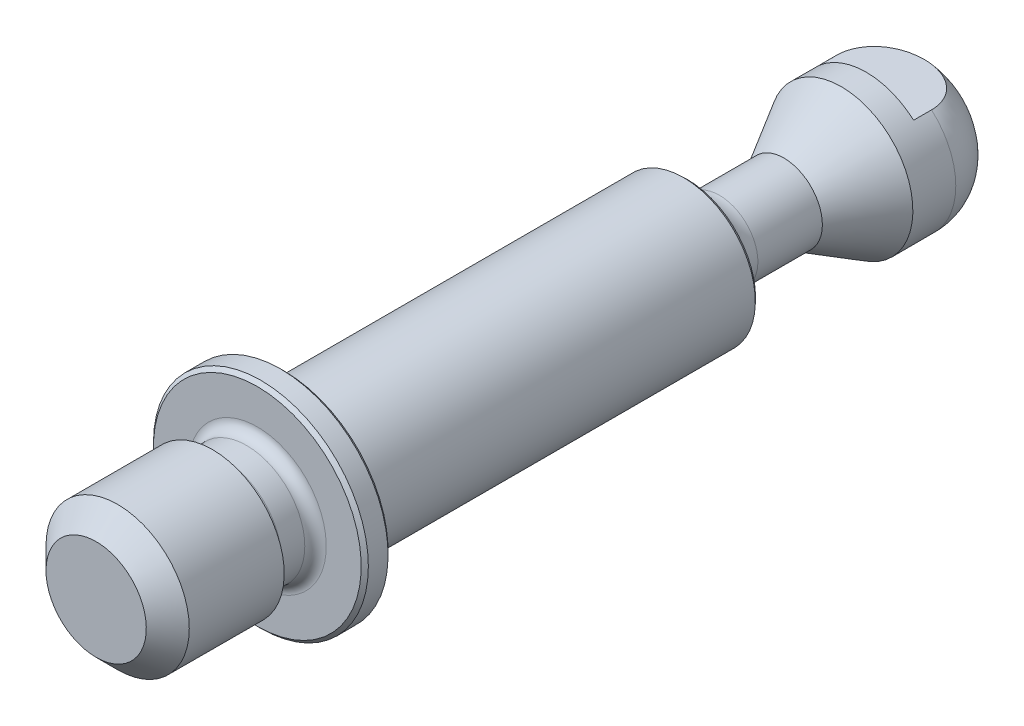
ISO-10303-21;
HEADER;
FILE_DESCRIPTION(('STEP AP214'),'2;1');
FILE_NAME('part.step','',(''),(''),'','','');
FILE_SCHEMA(('AUTOMOTIVE_DESIGN { 1 0 10303 214 1 1 1 1 }'));
ENDSEC;
DATA;
#1=APPLICATION_CONTEXT('core data for automotive mechanical design processes');
#2=APPLICATION_PROTOCOL_DEFINITION('international standard','automotive_design',2000,#1);
#3=PRODUCT_CONTEXT('',#1,'mechanical');
#4=PRODUCT('Part','Part','',(#3));
#5=PRODUCT_RELATED_PRODUCT_CATEGORY('part','',(#4));
#6=PRODUCT_DEFINITION_FORMATION('','',#4);
#7=PRODUCT_DEFINITION_CONTEXT('part definition',#1,'design');
#8=PRODUCT_DEFINITION('design','',#6,#7);
#9=PRODUCT_DEFINITION_SHAPE('','',#8);
#10=(LENGTH_UNIT() NAMED_UNIT(*) SI_UNIT(.MILLI.,.METRE.));
#11=(NAMED_UNIT(*) PLANE_ANGLE_UNIT() SI_UNIT($,.RADIAN.));
#12=(NAMED_UNIT(*) SI_UNIT($,.STERADIAN.) SOLID_ANGLE_UNIT());
#13=UNCERTAINTY_MEASURE_WITH_UNIT(LENGTH_MEASURE(1.E-05),#10,'distance_accuracy_value','');
#14=(GEOMETRIC_REPRESENTATION_CONTEXT(3) GLOBAL_UNCERTAINTY_ASSIGNED_CONTEXT((#13)) GLOBAL_UNIT_ASSIGNED_CONTEXT((#10,
#11,#12)) REPRESENTATION_CONTEXT('',''));
#15=CARTESIAN_POINT('',(0.,0.,0.));
#16=DIRECTION('',(0.,0.,1.));
#17=DIRECTION('',(1.,0.,0.));
#18=AXIS2_PLACEMENT_3D('',#15,#16,#17);
#19=CARTESIAN_POINT('',(0.,0.,0.));
#20=DIRECTION('',(0.,0.,1.));
#21=DIRECTION('',(0.,1.,0.));
#22=AXIS2_PLACEMENT_3D('',#19,#20,#21);
#23=CYLINDRICAL_SURFACE('',#22,6.);
#24=CARTESIAN_POINT('',(0.,0.,-0.2));
#25=DIRECTION('',(0.,0.,-1.));
#26=DIRECTION('',(0.,-1.,0.));
#27=AXIS2_PLACEMENT_3D('',#24,#25,#26);
#28=CIRCLE('',#27,6.);
#29=CARTESIAN_POINT('',(0.,-6.,-0.2));
#30=VERTEX_POINT('',#29);
#31=EDGE_CURVE('E228',#30,#30,#28,.T.);
#32=ORIENTED_EDGE('',*,*,#31,.T.);
#33=EDGE_LOOP('',(#32));
#34=FACE_BOUND('',#33,.T.);
#35=CARTESIAN_POINT('',(0.,0.,-1.3));
#36=DIRECTION('',(0.,0.,1.));
#37=DIRECTION('',(0.,1.,0.));
#38=AXIS2_PLACEMENT_3D('',#35,#36,#37);
#39=CIRCLE('',#38,6.);
#40=CARTESIAN_POINT('',(0.,6.,-1.3));
#41=VERTEX_POINT('',#40);
#42=EDGE_CURVE('E233',#41,#41,#39,.T.);
#43=ORIENTED_EDGE('',*,*,#42,.T.);
#44=EDGE_LOOP('',(#43));
#45=FACE_BOUND('',#44,.T.);
#46=ADVANCED_FACE('F15',(#34,#45),#23,.T.);
#47=CARTESIAN_POINT('',(-6.,0.,-1.5));
#48=DIRECTION('',(0.,0.,1.));
#49=DIRECTION('',(0.,1.,0.));
#50=AXIS2_PLACEMENT_3D('',#47,#48,#49);
#51=PLANE('',#50);
#52=CARTESIAN_POINT('',(0.,0.,-1.5));
#53=DIRECTION('',(0.,0.,1.));
#54=DIRECTION('',(0.,1.,0.));
#55=AXIS2_PLACEMENT_3D('',#52,#53,#54);
#56=CIRCLE('',#55,5.8);
#57=CARTESIAN_POINT('',(0.,5.8,-1.5));
#58=VERTEX_POINT('',#57);
#59=EDGE_CURVE('E226',#58,#58,#56,.F.);
#60=ORIENTED_EDGE('',*,*,#59,.T.);
#61=EDGE_LOOP('',(#60));
#62=FACE_BOUND('',#61,.T.);
#63=CARTESIAN_POINT('',(0.,0.,-1.5));
#64=DIRECTION('',(0.,0.,1.));
#65=DIRECTION('',(0.,1.,0.));
#66=AXIS2_PLACEMENT_3D('',#63,#64,#65);
#67=CIRCLE('',#66,4.4);
#68=CARTESIAN_POINT('',(0.,4.4,-1.5));
#69=VERTEX_POINT('',#68);
#70=EDGE_CURVE('E111',#69,#69,#67,.T.);
#71=ORIENTED_EDGE('',*,*,#70,.T.);
#72=EDGE_LOOP('',(#71));
#73=FACE_BOUND('',#72,.T.);
#74=ADVANCED_FACE('F183',(#62,#73),#51,.F.);
#75=CARTESIAN_POINT('',(0.,0.,0.));
#76=DIRECTION('',(0.,0.,1.));
#77=DIRECTION('',(0.,1.,0.));
#78=AXIS2_PLACEMENT_3D('',#75,#76,#77);
#79=CYLINDRICAL_SURFACE('',#78,4.);
#80=CARTESIAN_POINT('',(0.,0.,-23.8056329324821));
#81=DIRECTION('',(0.,0.,1.));
#82=DIRECTION('',(0.,1.,0.));
#83=AXIS2_PLACEMENT_3D('',#80,#81,#82);
#84=CIRCLE('',#83,4.);
#85=CARTESIAN_POINT('',(0.,4.,-23.8056329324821));
#86=VERTEX_POINT('',#85);
#87=EDGE_CURVE('E23',#86,#86,#84,.T.);
#88=ORIENTED_EDGE('',*,*,#87,.T.);
#89=EDGE_LOOP('',(#88));
#90=FACE_BOUND('',#89,.T.);
#91=CARTESIAN_POINT('',(0.,0.,-1.9));
#92=DIRECTION('',(0.,0.,1.));
#93=DIRECTION('',(0.,1.,0.));
#94=AXIS2_PLACEMENT_3D('',#91,#92,#93);
#95=CIRCLE('',#94,4.);
#96=CARTESIAN_POINT('',(0.,4.,-1.9));
#97=VERTEX_POINT('',#96);
#98=EDGE_CURVE('E114',#97,#97,#95,.F.);
#99=ORIENTED_EDGE('',*,*,#98,.T.);
#100=EDGE_LOOP('',(#99));
#101=FACE_BOUND('',#100,.T.);
#102=ADVANCED_FACE('F179',(#90,#101),#79,.T.);
#103=CARTESIAN_POINT('',(0.,0.,0.));
#104=DIRECTION('',(0.,0.,1.));
#105=DIRECTION('',(0.,1.,0.));
#106=AXIS2_PLACEMENT_3D('',#103,#104,#105);
#107=CYLINDRICAL_SURFACE('',#106,2.15);
#108=CARTESIAN_POINT('',(0.,0.,-25.8));
#109=DIRECTION('',(0.,0.,1.));
#110=DIRECTION('',(0.,1.,0.));
#111=AXIS2_PLACEMENT_3D('',#108,#109,#110);
#112=CIRCLE('',#111,2.15);
#113=CARTESIAN_POINT('',(0.,2.15,-25.8));
#114=VERTEX_POINT('',#113);
#115=EDGE_CURVE('E117',#114,#114,#112,.F.);
#116=ORIENTED_EDGE('',*,*,#115,.T.);
#117=EDGE_LOOP('',(#116));
#118=FACE_BOUND('',#117,.T.);
#119=CARTESIAN_POINT('',(0.,0.,-29.4));
#120=DIRECTION('',(0.,0.,1.));
#121=DIRECTION('',(0.,1.,0.));
#122=AXIS2_PLACEMENT_3D('',#119,#120,#121);
#123=CIRCLE('',#122,2.15);
#124=CARTESIAN_POINT('',(0.,2.15,-29.4));
#125=VERTEX_POINT('',#124);
#126=EDGE_CURVE('E90',#125,#125,#123,.T.);
#127=ORIENTED_EDGE('',*,*,#126,.T.);
#128=EDGE_LOOP('',(#127));
#129=FACE_BOUND('',#128,.T.);
#130=ADVANCED_FACE('F175',(#118,#129),#107,.T.);
#131=CARTESIAN_POINT('',(0.,0.,-32.6042939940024));
#132=DIRECTION('',(0.,0.,-1.));
#133=DIRECTION('',(0.,-1.,0.));
#134=AXIS2_PLACEMENT_3D('',#131,#132,#133);
#135=CONICAL_SURFACE('',#134,4.,0.523598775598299);
#136=ORIENTED_EDGE('',*,*,#126,.F.);
#137=EDGE_LOOP('',(#136));
#138=FACE_BOUND('',#137,.T.);
#139=CARTESIAN_POINT('',(0.,0.,-32.6042939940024));
#140=DIRECTION('',(0.,0.,1.));
#141=DIRECTION('',(0.,1.,0.));
#142=AXIS2_PLACEMENT_3D('',#139,#140,#141);
#143=CIRCLE('',#142,4.);
#144=CARTESIAN_POINT('',(0.,4.,-32.6042939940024));
#145=VERTEX_POINT('',#144);
#146=EDGE_CURVE('E87',#145,#145,#143,.T.);
#147=ORIENTED_EDGE('',*,*,#146,.T.);
#148=EDGE_LOOP('',(#147));
#149=FACE_BOUND('',#148,.T.);
#150=ADVANCED_FACE('F172',(#138,#149),#135,.T.);
#151=CARTESIAN_POINT('',(0.,0.,0.));
#152=DIRECTION('',(0.,0.,1.));
#153=DIRECTION('',(0.,1.,0.));
#154=AXIS2_PLACEMENT_3D('',#151,#152,#153);
#155=CYLINDRICAL_SURFACE('',#154,4.);
#156=CARTESIAN_POINT('',(0.,0.,-35.));
#157=DIRECTION('',(0.,0.,1.));
#158=DIRECTION('',(0.,1.,0.));
#159=AXIS2_PLACEMENT_3D('',#156,#157,#158);
#160=CIRCLE('',#159,4.);
#161=CARTESIAN_POINT('',(-2.6457513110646,3.,-35.));
#162=VERTEX_POINT('',#161);
#163=CARTESIAN_POINT('',(-2.6457513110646,-3.,-35.));
#164=VERTEX_POINT('',#163);
#165=EDGE_CURVE('E73',#162,#164,#160,.T.);
#166=ORIENTED_EDGE('',*,*,#165,.T.);
#167=DIRECTION('',(0.,0.,1.));
#168=VECTOR('',#167,1.);
#169=CARTESIAN_POINT('',(-2.6457513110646,-3.,0.));
#170=LINE('',#169,#168);
#171=CARTESIAN_POINT('',(-2.6457513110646,-3.,-34.));
#172=VERTEX_POINT('',#171);
#173=EDGE_CURVE('E30',#164,#172,#170,.T.);
#174=ORIENTED_EDGE('',*,*,#173,.T.);
#175=CARTESIAN_POINT('',(0.,0.,-34.));
#176=DIRECTION('',(0.,0.,-1.));
#177=DIRECTION('',(0.,-1.,0.));
#178=AXIS2_PLACEMENT_3D('',#175,#176,#177);
#179=CIRCLE('',#178,4.);
#180=CARTESIAN_POINT('',(2.6457513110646,-3.,-34.));
#181=VERTEX_POINT('',#180);
#182=EDGE_CURVE('E59',#181,#172,#179,.T.);
#183=ORIENTED_EDGE('',*,*,#182,.F.);
#184=DIRECTION('',(0.,0.,1.));
#185=VECTOR('',#184,1.);
#186=CARTESIAN_POINT('',(2.6457513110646,-3.,0.));
#187=LINE('',#186,#185);
#188=CARTESIAN_POINT('',(2.6457513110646,-3.,-35.));
#189=VERTEX_POINT('',#188);
#190=EDGE_CURVE('E66',#181,#189,#187,.F.);
#191=ORIENTED_EDGE('',*,*,#190,.T.);
#192=CARTESIAN_POINT('',(2.6457513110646,3.,-35.));
#193=VERTEX_POINT('',#192);
#194=EDGE_CURVE('E38',#189,#193,#160,.T.);
#195=ORIENTED_EDGE('',*,*,#194,.T.);
#196=DIRECTION('',(0.,0.,1.));
#197=VECTOR('',#196,1.);
#198=CARTESIAN_POINT('',(2.6457513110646,3.,0.));
#199=LINE('',#198,#197);
#200=CARTESIAN_POINT('',(2.6457513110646,3.,-34.));
#201=VERTEX_POINT('',#200);
#202=EDGE_CURVE('E82',#193,#201,#199,.T.);
#203=ORIENTED_EDGE('',*,*,#202,.T.);
#204=CARTESIAN_POINT('',(0.,0.,-34.));
#205=DIRECTION('',(0.,0.,-1.));
#206=DIRECTION('',(0.,-1.,0.));
#207=AXIS2_PLACEMENT_3D('',#204,#205,#206);
#208=CIRCLE('',#207,4.);
#209=CARTESIAN_POINT('',(-2.6457513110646,3.,-34.));
#210=VERTEX_POINT('',#209);
#211=EDGE_CURVE('E131',#210,#201,#208,.T.);
#212=ORIENTED_EDGE('',*,*,#211,.F.);
#213=DIRECTION('',(0.,0.,1.));
#214=VECTOR('',#213,1.);
#215=CARTESIAN_POINT('',(-2.6457513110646,3.,0.));
#216=LINE('',#215,#214);
#217=EDGE_CURVE('E77',#210,#162,#216,.F.);
#218=ORIENTED_EDGE('',*,*,#217,.T.);
#219=EDGE_LOOP('',(#166,#174,#183,#191,#195,#203,#212,#218));
#220=FACE_BOUND('',#219,.T.);
#221=ORIENTED_EDGE('',*,*,#146,.F.);
#222=EDGE_LOOP('',(#221));
#223=FACE_BOUND('',#222,.T.);
#224=ADVANCED_FACE('F69',(#220,#223),#155,.T.);
#225=CARTESIAN_POINT('',(0.,0.,-38.));
#226=DIRECTION('',(0.,0.,1.));
#227=DIRECTION('',(0.,1.,0.));
#228=AXIS2_PLACEMENT_3D('',#225,#226,#227);
#229=PLANE('',#228);
#230=CARTESIAN_POINT('',(0.,0.,-38.));
#231=DIRECTION('',(0.,0.,1.));
#232=DIRECTION('',(0.,1.,0.));
#233=AXIS2_PLACEMENT_3D('',#230,#231,#232);
#234=CIRCLE('',#233,1.);
#235=CARTESIAN_POINT('',(0.,1.,-38.));
#236=VERTEX_POINT('',#235);
#237=EDGE_CURVE('E121',#236,#236,#234,.F.);
#238=ORIENTED_EDGE('',*,*,#237,.T.);
#239=EDGE_LOOP('',(#238));
#240=FACE_BOUND('',#239,.T.);
#241=ADVANCED_FACE('F165',(#240),#229,.F.);
#242=CARTESIAN_POINT('',(-4.,0.,9.));
#243=DIRECTION('',(0.,0.,-1.));
#244=DIRECTION('',(0.,-1.,0.));
#245=AXIS2_PLACEMENT_3D('',#242,#243,#244);
#246=PLANE('',#245);
#247=CARTESIAN_POINT('',(0.,0.,9.));
#248=DIRECTION('',(0.,0.,-1.));
#249=DIRECTION('',(0.,-1.,0.));
#250=AXIS2_PLACEMENT_3D('',#247,#248,#249);
#251=CIRCLE('',#250,2.8);
#252=CARTESIAN_POINT('',(0.,-2.8,9.));
#253=VERTEX_POINT('',#252);
#254=EDGE_CURVE('E93',#253,#253,#251,.F.);
#255=ORIENTED_EDGE('',*,*,#254,.T.);
#256=EDGE_LOOP('',(#255));
#257=FACE_BOUND('',#256,.T.);
#258=ADVANCED_FACE('F161',(#257),#246,.F.);
#259=CARTESIAN_POINT('',(0.,0.,0.));
#260=DIRECTION('',(0.,0.,1.));
#261=DIRECTION('',(0.,1.,0.));
#262=AXIS2_PLACEMENT_3D('',#259,#260,#261);
#263=CYLINDRICAL_SURFACE('',#262,4.);
#264=CARTESIAN_POINT('',(0.,0.,7.8));
#265=DIRECTION('',(0.,0.,-1.));
#266=DIRECTION('',(0.,-1.,0.));
#267=AXIS2_PLACEMENT_3D('',#264,#265,#266);
#268=CIRCLE('',#267,4.);
#269=CARTESIAN_POINT('',(0.,-4.,7.8));
#270=VERTEX_POINT('',#269);
#271=EDGE_CURVE('E96',#270,#270,#268,.T.);
#272=ORIENTED_EDGE('',*,*,#271,.T.);
#273=EDGE_LOOP('',(#272));
#274=FACE_BOUND('',#273,.T.);
#275=CARTESIAN_POINT('',(0.,0.,2.5));
#276=DIRECTION('',(0.,0.,1.));
#277=DIRECTION('',(0.,1.,0.));
#278=AXIS2_PLACEMENT_3D('',#275,#276,#277);
#279=CIRCLE('',#278,4.);
#280=CARTESIAN_POINT('',(0.,4.,2.5));
#281=VERTEX_POINT('',#280);
#282=EDGE_CURVE('E84',#281,#281,#279,.T.);
#283=ORIENTED_EDGE('',*,*,#282,.T.);
#284=EDGE_LOOP('',(#283));
#285=FACE_BOUND('',#284,.T.);
#286=ADVANCED_FACE('F157',(#274,#285),#263,.T.);
#287=CARTESIAN_POINT('',(-3.25,0.,2.5));
#288=DIRECTION('',(0.,0.,1.));
#289=DIRECTION('',(0.,1.,0.));
#290=AXIS2_PLACEMENT_3D('',#287,#288,#289);
#291=PLANE('',#290);
#292=CARTESIAN_POINT('',(0.,0.,2.5));
#293=DIRECTION('',(0.,0.,1.));
#294=DIRECTION('',(0.,1.,0.));
#295=AXIS2_PLACEMENT_3D('',#292,#293,#294);
#296=CIRCLE('',#295,3.85);
#297=CARTESIAN_POINT('',(0.,3.85,2.5));
#298=VERTEX_POINT('',#297);
#299=EDGE_CURVE('E99',#298,#298,#296,.T.);
#300=ORIENTED_EDGE('',*,*,#299,.T.);
#301=EDGE_LOOP('',(#300));
#302=FACE_BOUND('',#301,.T.);
#303=ORIENTED_EDGE('',*,*,#282,.F.);
#304=EDGE_LOOP('',(#303));
#305=FACE_BOUND('',#304,.T.);
#306=ADVANCED_FACE('F153',(#302,#305),#291,.F.);
#307=CARTESIAN_POINT('',(0.,0.,0.));
#308=DIRECTION('',(0.,0.,1.));
#309=DIRECTION('',(0.,1.,0.));
#310=AXIS2_PLACEMENT_3D('',#307,#308,#309);
#311=CYLINDRICAL_SURFACE('',#310,3.25);
#312=CARTESIAN_POINT('',(0.,0.,1.9));
#313=DIRECTION('',(0.,0.,1.));
#314=DIRECTION('',(0.,1.,0.));
#315=AXIS2_PLACEMENT_3D('',#312,#313,#314);
#316=CIRCLE('',#315,3.25);
#317=CARTESIAN_POINT('',(0.,3.25,1.9));
#318=VERTEX_POINT('',#317);
#319=EDGE_CURVE('E105',#318,#318,#316,.F.);
#320=ORIENTED_EDGE('',*,*,#319,.T.);
#321=EDGE_LOOP('',(#320));
#322=FACE_BOUND('',#321,.T.);
#323=CARTESIAN_POINT('',(0.,0.,0.6));
#324=DIRECTION('',(0.,0.,-1.));
#325=DIRECTION('',(0.,-1.,0.));
#326=AXIS2_PLACEMENT_3D('',#323,#324,#325);
#327=CIRCLE('',#326,3.25);
#328=CARTESIAN_POINT('',(0.,-3.25,0.6));
#329=VERTEX_POINT('',#328);
#330=EDGE_CURVE('E102',#329,#329,#327,.F.);
#331=ORIENTED_EDGE('',*,*,#330,.T.);
#332=EDGE_LOOP('',(#331));
#333=FACE_BOUND('',#332,.T.);
#334=ADVANCED_FACE('F149',(#322,#333),#311,.T.);
#335=CARTESIAN_POINT('',(-3.25,0.,0.));
#336=DIRECTION('',(0.,0.,-1.));
#337=DIRECTION('',(0.,-1.,0.));
#338=AXIS2_PLACEMENT_3D('',#335,#336,#337);
#339=PLANE('',#338);
#340=CARTESIAN_POINT('',(0.,0.,0.));
#341=DIRECTION('',(0.,0.,-1.));
#342=DIRECTION('',(0.,-1.,0.));
#343=AXIS2_PLACEMENT_3D('',#340,#341,#342);
#344=CIRCLE('',#343,5.8);
#345=CARTESIAN_POINT('',(0.,-5.8,0.));
#346=VERTEX_POINT('',#345);
#347=EDGE_CURVE('E62',#346,#346,#344,.F.);
#348=ORIENTED_EDGE('',*,*,#347,.T.);
#349=EDGE_LOOP('',(#348));
#350=FACE_BOUND('',#349,.T.);
#351=CARTESIAN_POINT('',(0.,0.,0.));
#352=DIRECTION('',(0.,0.,-1.));
#353=DIRECTION('',(0.,-1.,0.));
#354=AXIS2_PLACEMENT_3D('',#351,#352,#353);
#355=CIRCLE('',#354,3.85);
#356=CARTESIAN_POINT('',(0.,-3.85,0.));
#357=VERTEX_POINT('',#356);
#358=EDGE_CURVE('E108',#357,#357,#355,.T.);
#359=ORIENTED_EDGE('',*,*,#358,.T.);
#360=EDGE_LOOP('',(#359));
#361=FACE_BOUND('',#360,.T.);
#362=ADVANCED_FACE('F145',(#350,#361),#339,.F.);
#363=CARTESIAN_POINT('',(0.,0.,9.));
#364=DIRECTION('',(0.,0.,-1.));
#365=DIRECTION('',(0.,-1.,0.));
#366=AXIS2_PLACEMENT_3D('',#363,#364,#365);
#367=CONICAL_SURFACE('',#366,2.8,0.785398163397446);
#368=ORIENTED_EDGE('',*,*,#271,.F.);
#369=EDGE_LOOP('',(#368));
#370=FACE_BOUND('',#369,.T.);
#371=ORIENTED_EDGE('',*,*,#254,.F.);
#372=EDGE_LOOP('',(#371));
#373=FACE_BOUND('',#372,.T.);
#374=ADVANCED_FACE('F148',(#370,#373),#367,.T.);
#375=CARTESIAN_POINT('',(0.,0.,1.9));
#376=DIRECTION('',(0.,0.,1.));
#377=DIRECTION('',(0.,1.,0.));
#378=AXIS2_PLACEMENT_3D('',#375,#376,#377);
#379=TOROIDAL_SURFACE('',#378,3.85,0.6);
#380=ORIENTED_EDGE('',*,*,#319,.F.);
#381=EDGE_LOOP('',(#380));
#382=FACE_BOUND('',#381,.T.);
#383=ORIENTED_EDGE('',*,*,#299,.F.);
#384=EDGE_LOOP('',(#383));
#385=FACE_BOUND('',#384,.T.);
#386=ADVANCED_FACE('F193',(#382,#385),#379,.F.);
#387=CARTESIAN_POINT('',(0.,0.,0.6));
#388=DIRECTION('',(0.,0.,-1.));
#389=DIRECTION('',(0.,-1.,0.));
#390=AXIS2_PLACEMENT_3D('',#387,#388,#389);
#391=TOROIDAL_SURFACE('',#390,3.85,0.6);
#392=ORIENTED_EDGE('',*,*,#358,.F.);
#393=EDGE_LOOP('',(#392));
#394=FACE_BOUND('',#393,.T.);
#395=ORIENTED_EDGE('',*,*,#330,.F.);
#396=EDGE_LOOP('',(#395));
#397=FACE_BOUND('',#396,.T.);
#398=ADVANCED_FACE('F197',(#394,#397),#391,.F.);
#399=CARTESIAN_POINT('',(0.,0.,-1.9));
#400=DIRECTION('',(0.,0.,1.));
#401=DIRECTION('',(0.,1.,0.));
#402=AXIS2_PLACEMENT_3D('',#399,#400,#401);
#403=TOROIDAL_SURFACE('',#402,4.4,0.4);
#404=ORIENTED_EDGE('',*,*,#98,.F.);
#405=EDGE_LOOP('',(#404));
#406=FACE_BOUND('',#405,.T.);
#407=ORIENTED_EDGE('',*,*,#70,.F.);
#408=EDGE_LOOP('',(#407));
#409=FACE_BOUND('',#408,.T.);
#410=ADVANCED_FACE('F201',(#406,#409),#403,.F.);
#411=CARTESIAN_POINT('',(0.,0.,-25.8));
#412=DIRECTION('',(0.,0.,1.));
#413=DIRECTION('',(0.,1.,0.));
#414=AXIS2_PLACEMENT_3D('',#411,#412,#413);
#415=TOROIDAL_SURFACE('',#414,3.95,1.8);
#416=CARTESIAN_POINT('',(0.,0.,-24.0050696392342));
#417=DIRECTION('',(0.,0.,-1.));
#418=DIRECTION('',(0.,-1.,0.));
#419=AXIS2_PLACEMENT_3D('',#416,#417,#418);
#420=CIRCLE('',#419,3.815);
#421=CARTESIAN_POINT('',(0.,-3.815,-24.0050696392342));
#422=VERTEX_POINT('',#421);
#423=EDGE_CURVE('E10',#422,#422,#420,.T.);
#424=ORIENTED_EDGE('',*,*,#423,.T.);
#425=EDGE_LOOP('',(#424));
#426=FACE_BOUND('',#425,.T.);
#427=ORIENTED_EDGE('',*,*,#115,.F.);
#428=EDGE_LOOP('',(#427));
#429=FACE_BOUND('',#428,.T.);
#430=ADVANCED_FACE('F204',(#426,#429),#415,.F.);
#431=CARTESIAN_POINT('',(0.,0.,-35.));
#432=DIRECTION('',(0.,0.,1.));
#433=DIRECTION('',(0.,1.,0.));
#434=AXIS2_PLACEMENT_3D('',#431,#432,#433);
#435=DEGENERATE_TOROIDAL_SURFACE('',#434,1.,3.,.T.);
#436=CARTESIAN_POINT('',(0.,-3.,-37.2360679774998));
#437=CARTESIAN_POINT('',(0.182130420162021,-3.,-37.2360730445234));
#438=CARTESIAN_POINT('',(0.364315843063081,-3.,-37.2213187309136));
#439=CARTESIAN_POINT('',(0.723592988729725,-3.,-37.1613493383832));
#440=CARTESIAN_POINT('',(0.900689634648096,-3.,-37.1161648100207));
#441=CARTESIAN_POINT('',(1.20801765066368,-3.,-37.0061514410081));
#442=CARTESIAN_POINT('',(1.3403812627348,-3.,-36.9472966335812));
#443=CARTESIAN_POINT('',(1.59371415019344,-3.,-36.8086382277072));
#444=CARTESIAN_POINT('',(1.71469026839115,-3.,-36.7288473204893));
#445=CARTESIAN_POINT('',(1.94131475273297,-3.,-36.548058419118));
#446=CARTESIAN_POINT('',(2.04683753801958,-3.,-36.4469014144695));
#447=CARTESIAN_POINT('',(2.23610882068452,-3.,-36.2258543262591));
#448=CARTESIAN_POINT('',(2.31987165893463,-3.,-36.1059766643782));
#449=CARTESIAN_POINT('',(2.45137620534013,-3.,-35.8685696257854));
#450=CARTESIAN_POINT('',(2.50243931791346,-3.,-35.7528750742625));
#451=CARTESIAN_POINT('',(2.58222641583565,-3.,-35.5140328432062));
#452=CARTESIAN_POINT('',(2.61096503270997,-3.,-35.3908901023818));
#453=CARTESIAN_POINT('',(2.64317885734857,-3.,-35.1526642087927));
#454=CARTESIAN_POINT('',(2.64869439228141,-3.,-35.0378527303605));
#455=CARTESIAN_POINT('',(2.6398528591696,-3.,-34.8090131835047));
#456=CARTESIAN_POINT('',(2.62550060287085,-3.,-34.6949849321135));
#457=CARTESIAN_POINT('',(2.57811323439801,-3.,-34.4737675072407));
#458=CARTESIAN_POINT('',(2.54553396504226,-3.,-34.366479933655));
#459=CARTESIAN_POINT('',(2.4633087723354,-3.,-34.158681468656));
#460=CARTESIAN_POINT('',(2.41366206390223,-3.,-34.0581708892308));
#461=CARTESIAN_POINT('',(2.29748673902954,-3.,-33.8635303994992));
#462=CARTESIAN_POINT('',(2.23051545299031,-3.,-33.769665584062));
#463=CARTESIAN_POINT('',(2.08284770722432,-3.,-33.5934794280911));
#464=CARTESIAN_POINT('',(2.00214781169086,-3.,-33.5111609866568));
#465=CARTESIAN_POINT('',(1.8226461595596,-3.,-33.3531312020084));
#466=CARTESIAN_POINT('',(1.72291044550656,-3.,-33.2784840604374));
#467=CARTESIAN_POINT('',(1.5136045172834,-3.,-33.1446444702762));
#468=CARTESIAN_POINT('',(1.40403016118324,-3.,-33.0854585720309));
#469=CARTESIAN_POINT('',(1.16220414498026,-3.,-32.9752876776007));
#470=CARTESIAN_POINT('',(1.02891680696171,-3.,-32.9265841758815));
#471=CARTESIAN_POINT('',(0.756854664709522,-3.,-32.8483168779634));
#472=CARTESIAN_POINT('',(0.618076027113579,-3.,-32.8187667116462));
#473=CARTESIAN_POINT('',(0.311732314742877,-3.,-32.7741468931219));
#474=CARTESIAN_POINT('',(0.143620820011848,-3.,-32.7628003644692));
#475=CARTESIAN_POINT('',(-0.192610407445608,-3.,-32.7652425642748));
#476=CARTESIAN_POINT('',(-0.360729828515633,-3.,-32.7790661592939));
#477=CARTESIAN_POINT('',(-0.711775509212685,-3.,-32.8356870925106));
#478=CARTESIAN_POINT('',(-0.894221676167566,-3.,-32.8815892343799));
#479=CARTESIAN_POINT('',(-1.2467838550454,-3.,-33.0076571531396));
#480=CARTESIAN_POINT('',(-1.41692949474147,-3.,-33.0877371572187));
#481=CARTESIAN_POINT('',(-1.68782709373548,-3.,-33.253590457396));
#482=CARTESIAN_POINT('',(-1.79407437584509,-3.,-33.3304326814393));
#483=CARTESIAN_POINT('',(-1.99244199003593,-3.,-33.5006681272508));
#484=CARTESIAN_POINT('',(-2.08456939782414,-3.,-33.5940530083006));
#485=CARTESIAN_POINT('',(-2.25136410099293,-3.,-33.7962389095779));
#486=CARTESIAN_POINT('',(-2.32593419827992,-3.,-33.9051206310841));
#487=CARTESIAN_POINT('',(-2.45340856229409,-3.,-34.1349484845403));
#488=CARTESIAN_POINT('',(-2.50632050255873,-3.,-34.2558903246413));
#489=CARTESIAN_POINT('',(-2.58380733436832,-3.,-34.4936035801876));
#490=CARTESIAN_POINT('',(-2.61062950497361,-3.,-34.6096453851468));
#491=CARTESIAN_POINT('',(-2.6431990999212,-3.,-34.8446356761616));
#492=CARTESIAN_POINT('',(-2.648955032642,-3.,-34.9635829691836));
#493=CARTESIAN_POINT('',(-2.6394119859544,-3.,-35.1942716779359));
#494=CARTESIAN_POINT('',(-2.62521418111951,-3.,-35.3060605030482));
#495=CARTESIAN_POINT('',(-2.57829739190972,-3.,-35.525661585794));
#496=CARTESIAN_POINT('',(-2.54557999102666,-3.,-35.6334741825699));
#497=CARTESIAN_POINT('',(-2.46277618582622,-3.,-35.8425934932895));
#498=CARTESIAN_POINT('',(-2.41263246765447,-3.,-35.943877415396));
#499=CARTESIAN_POINT('',(-2.2968802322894,-3.,-36.1371530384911));
#500=CARTESIAN_POINT('',(-2.23126933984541,-3.,-36.2291433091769));
#501=CARTESIAN_POINT('',(-2.08293087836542,-3.,-36.4067191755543));
#502=CARTESIAN_POINT('',(-1.99947023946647,-3.,-36.4916905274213));
#503=CARTESIAN_POINT('',(-1.82071046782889,-3.,-36.6480453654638));
#504=CARTESIAN_POINT('',(-1.72540724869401,-3.,-36.7194241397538));
#505=CARTESIAN_POINT('',(-1.51485660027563,-3.,-36.8550675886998));
#506=CARTESIAN_POINT('',(-1.39856751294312,-3.,-36.9177097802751));
#507=CARTESIAN_POINT('',(-1.1582831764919,-3.,-37.0257432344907));
#508=CARTESIAN_POINT('',(-1.03428427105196,-3.,-37.0711262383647));
#509=CARTESIAN_POINT('',(-0.760833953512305,-3.,-37.1513162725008));
#510=CARTESIAN_POINT('',(-0.6105265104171,-3.,-37.1831966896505));
#511=CARTESIAN_POINT('',(-0.306828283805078,-3.,-37.2255846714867));
#512=CARTESIAN_POINT('',(-0.153433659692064,-3.,-37.2360637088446));
#513=CARTESIAN_POINT('',(0.,-3.,-37.2360679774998));
#514=B_SPLINE_CURVE_WITH_KNOTS('',3,(#436,#437,#438,#439,#440,#441,#442,#443,#444,#445,#446,
#447,#448,#449,#450,#451,#452,#453,#454,#455,#456,#457,#458,#459,#460,#461,#462,#463,#464,#465,
#466,#467,#468,#469,#470,#471,#472,#473,#474,#475,#476,#477,#478,#479,#480,#481,#482,#483,#484,
#485,#486,#487,#488,#489,#490,#491,#492,#493,#494,#495,#496,#497,#498,#499,#500,#501,#502,#503,
#504,#505,#506,#507,#508,#509,#510,#511,#512,#513),.UNSPECIFIED.,.T.,.F.,(4,2,2,2,2,2,2,2,2,2,2,
2,2,2,2,2,2,2,2,2,2,2,2,2,2,2,2,2,2,2,2,2,2,2,2,2,2,2,4),(0.,0.545881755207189,1.09121628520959,
1.52407148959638,1.95666490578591,2.39259896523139,2.82824498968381,3.20555876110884,
3.58262503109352,3.92576653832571,4.2688249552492,4.60366436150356,4.93851917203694,
5.28296170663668,5.62749057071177,5.99973468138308,6.37213624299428,6.79627198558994,
7.22070922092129,7.72421554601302,8.22841987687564,8.78974139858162,9.34966243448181,
9.74144173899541,10.1330240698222,10.5267257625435,10.9202878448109,11.2757520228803,
11.6310726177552,11.9675363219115,12.3039712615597,12.6415233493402,12.9791273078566,
13.3349649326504,13.6909256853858,14.0856703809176,14.4806037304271,14.9398637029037,
15.3997354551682),.UNSPECIFIED.);
#515=EDGE_CURVE('E63',#164,#189,#514,.T.);
#516=ORIENTED_EDGE('',*,*,#515,.F.);
#517=ORIENTED_EDGE('',*,*,#165,.F.);
#518=CARTESIAN_POINT('',(0.,3.,-37.2360679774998));
#519=CARTESIAN_POINT('',(-0.182130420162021,3.,-37.2360730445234));
#520=CARTESIAN_POINT('',(-0.364315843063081,3.,-37.2213187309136));
#521=CARTESIAN_POINT('',(-0.723592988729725,3.,-37.1613493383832));
#522=CARTESIAN_POINT('',(-0.900689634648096,3.,-37.1161648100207));
#523=CARTESIAN_POINT('',(-1.20801765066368,3.,-37.0061514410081));
#524=CARTESIAN_POINT('',(-1.3403812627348,3.,-36.9472966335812));
#525=CARTESIAN_POINT('',(-1.59371415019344,3.,-36.8086382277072));
#526=CARTESIAN_POINT('',(-1.71469026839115,3.,-36.7288473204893));
#527=CARTESIAN_POINT('',(-1.94131475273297,3.,-36.548058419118));
#528=CARTESIAN_POINT('',(-2.04683753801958,3.,-36.4469014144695));
#529=CARTESIAN_POINT('',(-2.23610882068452,3.,-36.2258543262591));
#530=CARTESIAN_POINT('',(-2.31987165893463,3.,-36.1059766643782));
#531=CARTESIAN_POINT('',(-2.45137620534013,3.,-35.8685696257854));
#532=CARTESIAN_POINT('',(-2.50243931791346,3.,-35.7528750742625));
#533=CARTESIAN_POINT('',(-2.58222641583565,3.,-35.5140328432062));
#534=CARTESIAN_POINT('',(-2.61096503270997,3.,-35.3908901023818));
#535=CARTESIAN_POINT('',(-2.64317885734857,3.,-35.1526642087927));
#536=CARTESIAN_POINT('',(-2.64869439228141,3.,-35.0378527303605));
#537=CARTESIAN_POINT('',(-2.6398528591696,3.,-34.8090131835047));
#538=CARTESIAN_POINT('',(-2.62550060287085,3.,-34.6949849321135));
#539=CARTESIAN_POINT('',(-2.57811323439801,3.,-34.4737675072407));
#540=CARTESIAN_POINT('',(-2.54553396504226,3.,-34.366479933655));
#541=CARTESIAN_POINT('',(-2.4633087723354,3.,-34.158681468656));
#542=CARTESIAN_POINT('',(-2.41366206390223,3.,-34.0581708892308));
#543=CARTESIAN_POINT('',(-2.29748673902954,3.,-33.8635303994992));
#544=CARTESIAN_POINT('',(-2.23051545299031,3.,-33.769665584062));
#545=CARTESIAN_POINT('',(-2.08284770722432,3.,-33.5934794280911));
#546=CARTESIAN_POINT('',(-2.00214781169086,3.,-33.5111609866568));
#547=CARTESIAN_POINT('',(-1.8226461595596,3.,-33.3531312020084));
#548=CARTESIAN_POINT('',(-1.72291044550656,3.,-33.2784840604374));
#549=CARTESIAN_POINT('',(-1.5136045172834,3.,-33.1446444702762));
#550=CARTESIAN_POINT('',(-1.40403016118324,3.,-33.0854585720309));
#551=CARTESIAN_POINT('',(-1.16220414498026,3.,-32.9752876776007));
#552=CARTESIAN_POINT('',(-1.02891680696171,3.,-32.9265841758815));
#553=CARTESIAN_POINT('',(-0.756854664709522,3.,-32.8483168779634));
#554=CARTESIAN_POINT('',(-0.618076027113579,3.,-32.8187667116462));
#555=CARTESIAN_POINT('',(-0.311732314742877,3.,-32.7741468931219));
#556=CARTESIAN_POINT('',(-0.143620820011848,3.,-32.7628003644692));
#557=CARTESIAN_POINT('',(0.192610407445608,3.,-32.7652425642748));
#558=CARTESIAN_POINT('',(0.360729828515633,3.,-32.7790661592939));
#559=CARTESIAN_POINT('',(0.711775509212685,3.,-32.8356870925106));
#560=CARTESIAN_POINT('',(0.894221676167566,3.,-32.8815892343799));
#561=CARTESIAN_POINT('',(1.2467838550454,3.,-33.0076571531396));
#562=CARTESIAN_POINT('',(1.41692949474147,3.,-33.0877371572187));
#563=CARTESIAN_POINT('',(1.68782709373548,3.,-33.253590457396));
#564=CARTESIAN_POINT('',(1.79407437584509,3.,-33.3304326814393));
#565=CARTESIAN_POINT('',(1.99244199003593,3.,-33.5006681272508));
#566=CARTESIAN_POINT('',(2.08456939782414,3.,-33.5940530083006));
#567=CARTESIAN_POINT('',(2.25136410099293,3.,-33.7962389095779));
#568=CARTESIAN_POINT('',(2.32593419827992,3.,-33.9051206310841));
#569=CARTESIAN_POINT('',(2.45340856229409,3.,-34.1349484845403));
#570=CARTESIAN_POINT('',(2.50632050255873,3.,-34.2558903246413));
#571=CARTESIAN_POINT('',(2.58380733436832,3.,-34.4936035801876));
#572=CARTESIAN_POINT('',(2.61062950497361,3.,-34.6096453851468));
#573=CARTESIAN_POINT('',(2.6431990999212,3.,-34.8446356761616));
#574=CARTESIAN_POINT('',(2.648955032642,3.,-34.9635829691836));
#575=CARTESIAN_POINT('',(2.6394119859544,3.,-35.1942716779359));
#576=CARTESIAN_POINT('',(2.62521418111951,3.,-35.3060605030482));
#577=CARTESIAN_POINT('',(2.57829739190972,3.,-35.525661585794));
#578=CARTESIAN_POINT('',(2.54557999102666,3.,-35.6334741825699));
#579=CARTESIAN_POINT('',(2.46277618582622,3.,-35.8425934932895));
#580=CARTESIAN_POINT('',(2.41263246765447,3.,-35.943877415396));
#581=CARTESIAN_POINT('',(2.2968802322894,3.,-36.1371530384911));
#582=CARTESIAN_POINT('',(2.23126933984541,3.,-36.2291433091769));
#583=CARTESIAN_POINT('',(2.08293087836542,3.,-36.4067191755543));
#584=CARTESIAN_POINT('',(1.99947023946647,3.,-36.4916905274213));
#585=CARTESIAN_POINT('',(1.82071046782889,3.,-36.6480453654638));
#586=CARTESIAN_POINT('',(1.72540724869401,3.,-36.7194241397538));
#587=CARTESIAN_POINT('',(1.51485660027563,3.,-36.8550675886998));
#588=CARTESIAN_POINT('',(1.39856751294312,3.,-36.9177097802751));
#589=CARTESIAN_POINT('',(1.1582831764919,3.,-37.0257432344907));
#590=CARTESIAN_POINT('',(1.03428427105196,3.,-37.0711262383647));
#591=CARTESIAN_POINT('',(0.760833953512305,3.,-37.1513162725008));
#592=CARTESIAN_POINT('',(0.6105265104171,3.,-37.1831966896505));
#593=CARTESIAN_POINT('',(0.306828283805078,3.,-37.2255846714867));
#594=CARTESIAN_POINT('',(0.153433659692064,3.,-37.2360637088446));
#595=CARTESIAN_POINT('',(0.,3.,-37.2360679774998));
#596=B_SPLINE_CURVE_WITH_KNOTS('',3,(#518,#519,#520,#521,#522,#523,#524,#525,#526,#527,#528,
#529,#530,#531,#532,#533,#534,#535,#536,#537,#538,#539,#540,#541,#542,#543,#544,#545,#546,#547,
#548,#549,#550,#551,#552,#553,#554,#555,#556,#557,#558,#559,#560,#561,#562,#563,#564,#565,#566,
#567,#568,#569,#570,#571,#572,#573,#574,#575,#576,#577,#578,#579,#580,#581,#582,#583,#584,#585,
#586,#587,#588,#589,#590,#591,#592,#593,#594,#595),.UNSPECIFIED.,.T.,.F.,(4,2,2,2,2,2,2,2,2,2,2,
2,2,2,2,2,2,2,2,2,2,2,2,2,2,2,2,2,2,2,2,2,2,2,2,2,2,2,4),(0.,0.545881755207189,1.09121628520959,
1.52407148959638,1.95666490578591,2.39259896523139,2.82824498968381,3.20555876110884,
3.58262503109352,3.92576653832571,4.2688249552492,4.60366436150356,4.93851917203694,
5.28296170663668,5.62749057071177,5.99973468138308,6.37213624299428,6.79627198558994,
7.22070922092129,7.72421554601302,8.22841987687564,8.78974139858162,9.34966243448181,
9.74144173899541,10.1330240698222,10.5267257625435,10.9202878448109,11.2757520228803,
11.6310726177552,11.9675363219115,12.3039712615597,12.6415233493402,12.9791273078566,
13.3349649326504,13.6909256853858,14.0856703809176,14.4806037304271,14.9398637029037,
15.3997354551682),.UNSPECIFIED.);
#597=EDGE_CURVE('E124',#193,#162,#596,.T.);
#598=ORIENTED_EDGE('',*,*,#597,.F.);
#599=ORIENTED_EDGE('',*,*,#194,.F.);
#600=EDGE_LOOP('',(#516,#517,#598,#599));
#601=FACE_BOUND('',#600,.T.);
#602=ORIENTED_EDGE('',*,*,#237,.F.);
#603=EDGE_LOOP('',(#602));
#604=FACE_BOUND('',#603,.T.);
#605=ADVANCED_FACE('F133',(#601,#604),#435,.T.);
#606=CARTESIAN_POINT('',(5.,3.,-34.));
#607=DIRECTION('',(0.,0.,-1.));
#608=DIRECTION('',(0.,-1.,0.));
#609=AXIS2_PLACEMENT_3D('',#606,#607,#608);
#610=PLANE('',#609);
#611=ORIENTED_EDGE('',*,*,#211,.T.);
#612=DIRECTION('',(-1.,0.,0.));
#613=VECTOR('',#612,1.);
#614=CARTESIAN_POINT('',(5.,3.,-34.));
#615=LINE('',#614,#613);
#616=EDGE_CURVE('E74',#201,#210,#615,.T.);
#617=ORIENTED_EDGE('',*,*,#616,.T.);
#618=EDGE_LOOP('',(#611,#617));
#619=FACE_BOUND('',#618,.T.);
#620=ADVANCED_FACE('F142',(#619),#610,.T.);
#621=CARTESIAN_POINT('',(5.,3.,-34.));
#622=DIRECTION('',(0.,-1.,0.));
#623=DIRECTION('',(1.,0.,0.));
#624=AXIS2_PLACEMENT_3D('',#621,#622,#623);
#625=PLANE('',#624);
#626=ORIENTED_EDGE('',*,*,#597,.T.);
#627=ORIENTED_EDGE('',*,*,#217,.F.);
#628=ORIENTED_EDGE('',*,*,#616,.F.);
#629=ORIENTED_EDGE('',*,*,#202,.F.);
#630=EDGE_LOOP('',(#626,#627,#628,#629));
#631=FACE_BOUND('',#630,.T.);
#632=ADVANCED_FACE('F137',(#631),#625,.F.);
#633=CARTESIAN_POINT('',(-5.,-5.5,-34.));
#634=DIRECTION('',(0.,0.,-1.));
#635=DIRECTION('',(0.,-1.,0.));
#636=AXIS2_PLACEMENT_3D('',#633,#634,#635);
#637=PLANE('',#636);
#638=ORIENTED_EDGE('',*,*,#182,.T.);
#639=DIRECTION('',(1.,0.,0.));
#640=VECTOR('',#639,1.);
#641=CARTESIAN_POINT('',(5.,-3.,-34.));
#642=LINE('',#641,#640);
#643=EDGE_CURVE('E61',#172,#181,#642,.T.);
#644=ORIENTED_EDGE('',*,*,#643,.T.);
#645=EDGE_LOOP('',(#638,#644));
#646=FACE_BOUND('',#645,.T.);
#647=ADVANCED_FACE('F60',(#646),#637,.T.);
#648=CARTESIAN_POINT('',(5.,-3.,-34.));
#649=DIRECTION('',(0.,1.,0.));
#650=DIRECTION('',(-1.,0.,0.));
#651=AXIS2_PLACEMENT_3D('',#648,#649,#650);
#652=PLANE('',#651);
#653=ORIENTED_EDGE('',*,*,#515,.T.);
#654=ORIENTED_EDGE('',*,*,#190,.F.);
#655=ORIENTED_EDGE('',*,*,#643,.F.);
#656=ORIENTED_EDGE('',*,*,#173,.F.);
#657=EDGE_LOOP('',(#653,#654,#655,#656));
#658=FACE_BOUND('',#657,.T.);
#659=ADVANCED_FACE('F65',(#658),#652,.F.);
#660=CARTESIAN_POINT('',(0.,0.,0.));
#661=DIRECTION('',(0.,0.,-1.));
#662=DIRECTION('',(0.,-1.,0.));
#663=AXIS2_PLACEMENT_3D('',#660,#661,#662);
#664=CONICAL_SURFACE('',#663,5.8,0.785398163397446);
#665=ORIENTED_EDGE('',*,*,#31,.F.);
#666=EDGE_LOOP('',(#665));
#667=FACE_BOUND('',#666,.T.);
#668=ORIENTED_EDGE('',*,*,#347,.F.);
#669=EDGE_LOOP('',(#668));
#670=FACE_BOUND('',#669,.T.);
#671=ADVANCED_FACE('F243',(#667,#670),#664,.T.);
#672=CARTESIAN_POINT('',(0.,0.,-1.3));
#673=DIRECTION('',(0.,0.,1.));
#674=DIRECTION('',(0.,1.,0.));
#675=AXIS2_PLACEMENT_3D('',#672,#673,#674);
#676=CONICAL_SURFACE('',#675,6.,0.785398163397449);
#677=ORIENTED_EDGE('',*,*,#59,.F.);
#678=EDGE_LOOP('',(#677));
#679=FACE_BOUND('',#678,.T.);
#680=ORIENTED_EDGE('',*,*,#42,.F.);
#681=EDGE_LOOP('',(#680));
#682=FACE_BOUND('',#681,.T.);
#683=ADVANCED_FACE('F223',(#679,#682),#676,.T.);
#684=CARTESIAN_POINT('',(0.,0.,-23.8056329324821));
#685=DIRECTION('',(0.,0.,1.));
#686=DIRECTION('',(0.,1.,0.));
#687=AXIS2_PLACEMENT_3D('',#684,#685,#686);
#688=CONICAL_SURFACE('',#687,4.,0.747862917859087);
#689=ORIENTED_EDGE('',*,*,#423,.F.);
#690=EDGE_LOOP('',(#689));
#691=FACE_BOUND('',#690,.T.);
#692=ORIENTED_EDGE('',*,*,#87,.F.);
#693=EDGE_LOOP('',(#692));
#694=FACE_BOUND('',#693,.T.);
#695=ADVANCED_FACE('F17',(#691,#694),#688,.T.);
#696=CLOSED_SHELL('',(#46,#74,#102,#130,#150,#224,#241,#258,#286,#306,#334,#362,#374,#386,#398,
#410,#430,#605,#620,#632,#647,#659,#671,#683,#695));
#697=MANIFOLD_SOLID_BREP('B1',#696);
#698=ADVANCED_BREP_SHAPE_REPRESENTATION('',(#18,#697),#14);
#699=SHAPE_DEFINITION_REPRESENTATION(#9,#698);
ENDSEC;
END-ISO-10303-21;
